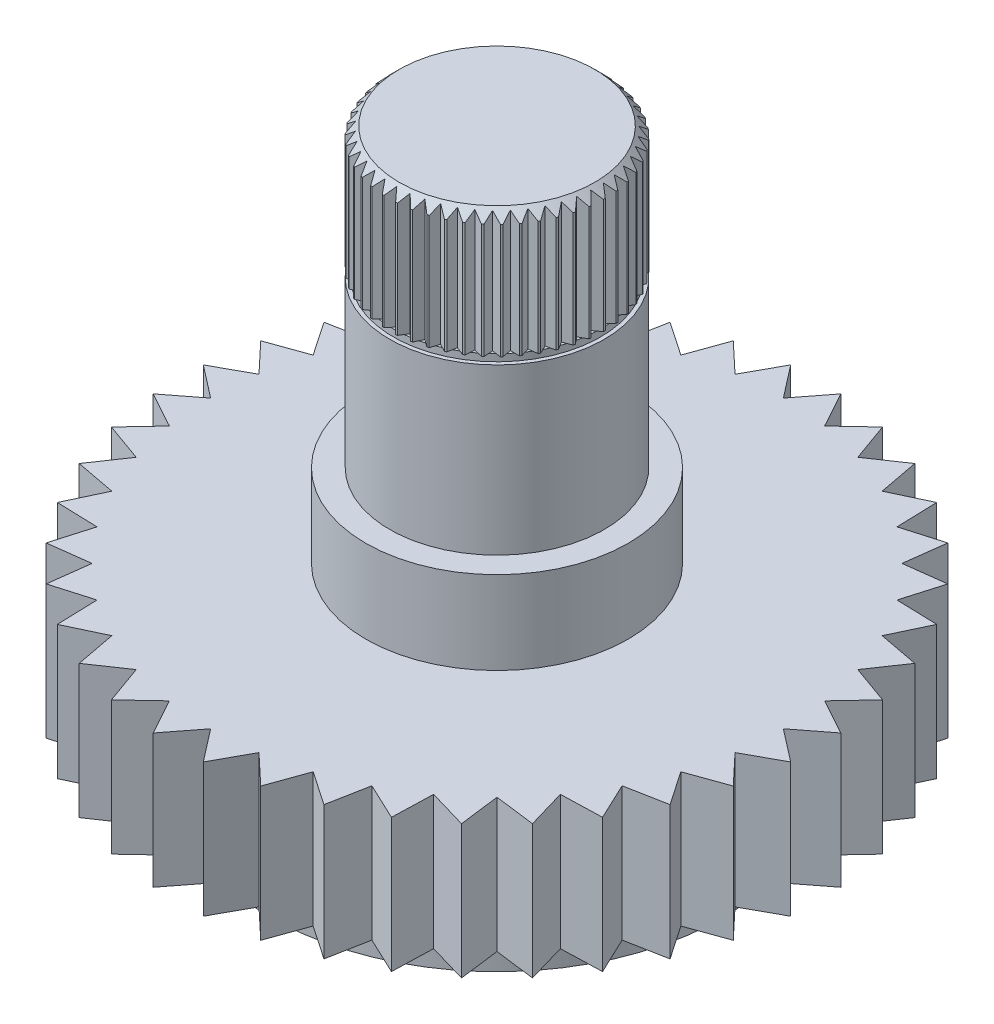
from build123d import *

# Parameters (mm, degrees)
CUT_EXTRUDE1_DEPTH = 2.032
CUT_EXTRUDE2_DEPTH = 16.699974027
CIRPATTERN1_COUNT  = 40
CHAMFER1_SIZE      = 0.254
CUT_EXTRUDE3_DEPTH = 3.302
CIRPATTERN2_COUNT  = 50


with BuildPart() as part:
    # Sketch1 → Revolve1 (revolve)
    with BuildSketch(Plane.XY, mode=Mode.PRIVATE) as revolve1_sk:
        Polygon((6.016, 0), (8.509, 0), (8.509, 3.556), (3.4925, 3.556), (3.4925, 5.7658), (2.8575, 5.7658), (2.8575, 10.150083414), (2.755528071, 10.150083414), (2.755528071, 10.3378), (2.8575, 10.3378), (2.8575, 13.6398), (0, 13.6398), (0, 0.9398), (5, 0.9398), (5, -1.6002), (6.016, -1.6002), align=None)
    revolve(revolve1_sk.sketch.rotate(Axis((0, 0, 0), (0, 1, 0)), 90), axis=Axis((0, 0, 0), (0, 1, 0)))

    # Sketch2 → Cut-Extrude1 (cut)
    with BuildSketch(Plane.XZ.offset(-0.9398)):
        with BuildLine():
            Line((0, 1.5875), (0, -1.5875))
            ThreePointArc((0, -1.5875), (1.5875, 0), (0, 1.5875))
        make_face()
    extrude(amount=-CUT_EXTRUDE1_DEPTH, mode=Mode.SUBTRACT)

    # Sketch3 → Cut-Extrude2 (cut, through all)
    with BuildSketch(Plane(origin=(0, 3.556, 0), x_dir=(-1, 0, 0), z_dir=(0, 1, 0))):
        with BuildLine():
            Line((0.667608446, -8.482769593), (0, -7.62))
            Line((0, -7.62), (-0.667608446, -8.482769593))
            ThreePointArc((-0.667608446, -8.482769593), (0, -8.509), (0.667608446, -8.482769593))
        make_face()
    cut_extrude2 = extrude(amount=-CUT_EXTRUDE2_DEPTH, mode=Mode.SUBTRACT)

    # CirPattern1: Cut-Extrude2 ×40 about axis
    cirpattern1_axis = Axis((0, 0, 0), (0, 1, 0))
    for i in range(1, CIRPATTERN1_COUNT):
        add(cut_extrude2.rotate(cirpattern1_axis, i * 360 / CIRPATTERN1_COUNT), mode=Mode.SUBTRACT)

    # Chamfer1
    chamfer1_edges = [part.edges().sort_by_distance(p)[0] for p in [
        (0, 13.6398, 2.8575),
    ]]
    chamfer(chamfer1_edges, length=CHAMFER1_SIZE)

    # Sketch4 → Cut-Extrude3 (cut)
    with BuildSketch(Plane(origin=(0, 13.6398, 0), x_dir=(-1, 0, 0), z_dir=(0, 1, 0))):
        with BuildLine():
            Line((0.155479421, -2.85326697), (0, -2.667))
            Line((0, -2.667), (-0.155479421, -2.85326697))
            ThreePointArc((-0.155479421, -2.85326697), (0, -2.8575), (0.155479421, -2.85326697))
        make_face()
    cut_extrude3 = extrude(amount=-CUT_EXTRUDE3_DEPTH, mode=Mode.SUBTRACT)

    # CirPattern2: Cut-Extrude3 ×50 about axis
    cirpattern2_axis = Axis((0, 0, 0), (0, 1, 0))
    for i in range(1, CIRPATTERN2_COUNT):
        add(cut_extrude3.rotate(cirpattern2_axis, i * 360 / CIRPATTERN2_COUNT), mode=Mode.SUBTRACT)


solid = part.part
